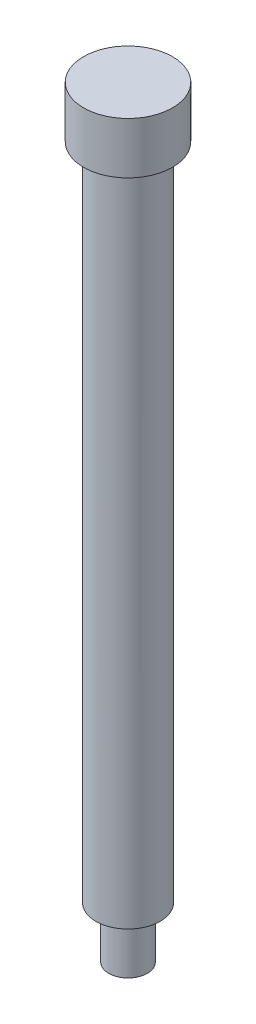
from build123d import *


with BuildPart() as part:
    # Sketch1 → Base-Revolve (revolve)
    with BuildSketch(Plane.XY, mode=Mode.PRIVATE) as base_revolve_sk:
        Polygon((0, 470.071117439), (0, 282.111117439), (-7.9375, 282.111117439), (-7.9375, 457.371117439), (-10.95375, 457.371117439), (-10.95375, 470.071117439), align=None)
    revolve(base_revolve_sk.sketch.rotate(Axis((0, 310.686117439, 0), (0, 1, 0)), 270), axis=Axis((0, 310.686117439, 0), (0, 1, 0)))

    # Sketch2 → 3_8-24 UNF-2A (revolve, cut)
    with BuildSketch(Plane.XY, mode=Mode.PRIVATE) as f_3_8_24_unf_2a_sk:
        with BuildLine():
            Line((-4.7625, 282.111117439), (-7.9375, 282.111117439))
            Line((-7.9375, 282.111117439), (-7.9375, 294.811117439))
            Line((-7.9375, 294.811117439), (-4.7625, 294.811117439))
            ThreePointArc((-4.7625, 294.811117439), (-4.20572412, 294.580493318), (-3.9751, 294.023717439))
            Line((-3.9751, 294.023717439), (-3.9751, 293.668117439))
            ThreePointArc((-3.9751, 293.668117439), (-4.20572412, 293.111341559), (-4.7625, 292.880717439))
            Line((-4.7625, 292.880717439), (-4.7625, 282.111117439))
        make_face()
    revolve(f_3_8_24_unf_2a_sk.sketch.rotate(Axis((0, 472.611117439, 0), (0, -1, 0)), 270), axis=Axis((0, 472.611117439, 0), (0, -1, 0)), mode=Mode.SUBTRACT)


solid = part.part
